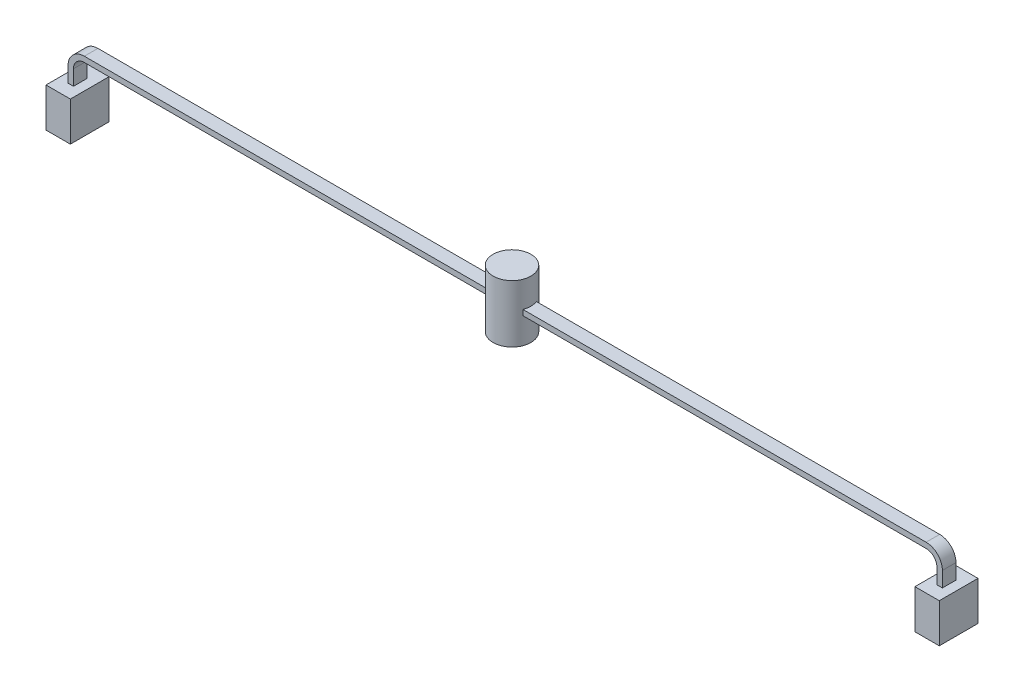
ISO-10303-21;
HEADER;
FILE_DESCRIPTION(('STEP AP214'),'2;1');
FILE_NAME('part.step','',(''),(''),'','','');
FILE_SCHEMA(('AUTOMOTIVE_DESIGN { 1 0 10303 214 1 1 1 1 }'));
ENDSEC;
DATA;
#1=APPLICATION_CONTEXT('core data for automotive mechanical design processes');
#2=APPLICATION_PROTOCOL_DEFINITION('international standard','automotive_design',2000,#1);
#3=PRODUCT_CONTEXT('',#1,'mechanical');
#4=PRODUCT('Part','Part','',(#3));
#5=PRODUCT_RELATED_PRODUCT_CATEGORY('part','',(#4));
#6=PRODUCT_DEFINITION_FORMATION('','',#4);
#7=PRODUCT_DEFINITION_CONTEXT('part definition',#1,'design');
#8=PRODUCT_DEFINITION('design','',#6,#7);
#9=PRODUCT_DEFINITION_SHAPE('','',#8);
#10=(LENGTH_UNIT() NAMED_UNIT(*) SI_UNIT(.MILLI.,.METRE.));
#11=(NAMED_UNIT(*) PLANE_ANGLE_UNIT() SI_UNIT($,.RADIAN.));
#12=(NAMED_UNIT(*) SI_UNIT($,.STERADIAN.) SOLID_ANGLE_UNIT());
#13=UNCERTAINTY_MEASURE_WITH_UNIT(LENGTH_MEASURE(1.E-05),#10,'distance_accuracy_value','');
#14=(GEOMETRIC_REPRESENTATION_CONTEXT(3) GLOBAL_UNCERTAINTY_ASSIGNED_CONTEXT((#13)) GLOBAL_UNIT_ASSIGNED_CONTEXT((#10,
#11,#12)) REPRESENTATION_CONTEXT('',''));
#15=CARTESIAN_POINT('',(0.,0.,0.));
#16=DIRECTION('',(0.,0.,1.));
#17=DIRECTION('',(1.,0.,0.));
#18=AXIS2_PLACEMENT_3D('',#15,#16,#17);
#19=CARTESIAN_POINT('',(0.,13.462,0.));
#20=DIRECTION('',(0.,-1.,0.));
#21=DIRECTION('',(0.,0.,-1.));
#22=AXIS2_PLACEMENT_3D('',#19,#20,#21);
#23=CYLINDRICAL_SURFACE('',#22,8.85255700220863);
#24=CARTESIAN_POINT('',(0.,-13.462,0.));
#25=DIRECTION('',(0.,1.,0.));
#26=DIRECTION('',(0.,0.,1.));
#27=AXIS2_PLACEMENT_3D('',#24,#25,#26);
#28=CIRCLE('',#27,8.85255700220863);
#29=CARTESIAN_POINT('',(0.,-13.462,8.85255700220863));
#30=VERTEX_POINT('',#29);
#31=EDGE_CURVE('E366',#30,#30,#28,.T.);
#32=ORIENTED_EDGE('',*,*,#31,.T.);
#33=EDGE_LOOP('',(#32));
#34=FACE_BOUND('',#33,.T.);
#35=CARTESIAN_POINT('',(0.,13.462,0.));
#36=DIRECTION('',(0.,1.,0.));
#37=DIRECTION('',(0.,0.,1.));
#38=AXIS2_PLACEMENT_3D('',#35,#36,#37);
#39=CIRCLE('',#38,8.85255700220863);
#40=CARTESIAN_POINT('',(0.,13.462,8.85255700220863));
#41=VERTEX_POINT('',#40);
#42=EDGE_CURVE('E367',#41,#41,#39,.T.);
#43=ORIENTED_EDGE('',*,*,#42,.F.);
#44=EDGE_LOOP('',(#43));
#45=FACE_BOUND('',#44,.T.);
#46=CARTESIAN_POINT('',(0.,-1.27,0.));
#47=DIRECTION('',(0.,1.,0.));
#48=DIRECTION('',(0.,0.,1.));
#49=AXIS2_PLACEMENT_3D('',#46,#47,#48);
#50=CIRCLE('',#49,8.85255700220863);
#51=CARTESIAN_POINT('',(8.26360335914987,-1.27,3.175));
#52=VERTEX_POINT('',#51);
#53=CARTESIAN_POINT('',(8.26360335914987,-1.27,-3.175));
#54=VERTEX_POINT('',#53);
#55=EDGE_CURVE('E375',#52,#54,#50,.T.);
#56=ORIENTED_EDGE('',*,*,#55,.F.);
#57=DIRECTION('',(0.,-1.,0.));
#58=VECTOR('',#57,1.);
#59=CARTESIAN_POINT('',(8.26360335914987,13.462,3.175));
#60=LINE('',#59,#58);
#61=CARTESIAN_POINT('',(8.26360335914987,1.27,3.175));
#62=VERTEX_POINT('',#61);
#63=EDGE_CURVE('E57',#52,#62,#60,.F.);
#64=ORIENTED_EDGE('',*,*,#63,.T.);
#65=CARTESIAN_POINT('',(0.,1.27,0.));
#66=DIRECTION('',(0.,1.,0.));
#67=DIRECTION('',(0.,0.,1.));
#68=AXIS2_PLACEMENT_3D('',#65,#66,#67);
#69=CIRCLE('',#68,8.85255700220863);
#70=CARTESIAN_POINT('',(8.26360335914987,1.27,-3.175));
#71=VERTEX_POINT('',#70);
#72=EDGE_CURVE('E378',#62,#71,#69,.T.);
#73=ORIENTED_EDGE('',*,*,#72,.T.);
#74=DIRECTION('',(0.,-1.,0.));
#75=VECTOR('',#74,1.);
#76=CARTESIAN_POINT('',(8.26360335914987,13.462,-3.175));
#77=LINE('',#76,#75);
#78=EDGE_CURVE('E370',#54,#71,#77,.F.);
#79=ORIENTED_EDGE('',*,*,#78,.F.);
#80=EDGE_LOOP('',(#56,#64,#73,#79));
#81=FACE_BOUND('',#80,.T.);
#82=DIRECTION('',(0.,-1.,0.));
#83=VECTOR('',#82,1.);
#84=CARTESIAN_POINT('',(-8.26360335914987,13.462,3.175));
#85=LINE('',#84,#83);
#86=CARTESIAN_POINT('',(-8.26360335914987,-1.27,3.175));
#87=VERTEX_POINT('',#86);
#88=CARTESIAN_POINT('',(-8.26360335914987,1.27,3.175));
#89=VERTEX_POINT('',#88);
#90=EDGE_CURVE('E11',#87,#89,#85,.F.);
#91=ORIENTED_EDGE('',*,*,#90,.F.);
#92=CARTESIAN_POINT('',(0.,-1.27,0.));
#93=DIRECTION('',(0.,-1.,0.));
#94=DIRECTION('',(0.,0.,-1.));
#95=AXIS2_PLACEMENT_3D('',#92,#93,#94);
#96=CIRCLE('',#95,8.85255700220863);
#97=CARTESIAN_POINT('',(-8.26360335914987,-1.27,-3.175));
#98=VERTEX_POINT('',#97);
#99=EDGE_CURVE('E42',#87,#98,#96,.T.);
#100=ORIENTED_EDGE('',*,*,#99,.T.);
#101=DIRECTION('',(0.,-1.,0.));
#102=VECTOR('',#101,1.);
#103=CARTESIAN_POINT('',(-8.26360335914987,13.462,-3.175));
#104=LINE('',#103,#102);
#105=CARTESIAN_POINT('',(-8.26360335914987,1.27,-3.175));
#106=VERTEX_POINT('',#105);
#107=EDGE_CURVE('E381',#98,#106,#104,.F.);
#108=ORIENTED_EDGE('',*,*,#107,.T.);
#109=CARTESIAN_POINT('',(0.,1.27,0.));
#110=DIRECTION('',(0.,-1.,0.));
#111=DIRECTION('',(0.,0.,-1.));
#112=AXIS2_PLACEMENT_3D('',#109,#110,#111);
#113=CIRCLE('',#112,8.85255700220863);
#114=EDGE_CURVE('E384',#89,#106,#113,.T.);
#115=ORIENTED_EDGE('',*,*,#114,.F.);
#116=EDGE_LOOP('',(#91,#100,#108,#115));
#117=FACE_BOUND('',#116,.T.);
#118=ADVANCED_FACE('F35',(#34,#45,#81,#117),#23,.T.);
#119=CARTESIAN_POINT('',(0.,13.462,0.));
#120=DIRECTION('',(0.,1.,0.));
#121=DIRECTION('',(0.,0.,1.));
#122=AXIS2_PLACEMENT_3D('',#119,#120,#121);
#123=PLANE('',#122);
#124=ORIENTED_EDGE('',*,*,#42,.T.);
#125=EDGE_LOOP('',(#124));
#126=FACE_BOUND('',#125,.T.);
#127=ADVANCED_FACE('F433',(#126),#123,.T.);
#128=CARTESIAN_POINT('',(0.,-13.462,0.));
#129=DIRECTION('',(0.,1.,0.));
#130=DIRECTION('',(0.,0.,1.));
#131=AXIS2_PLACEMENT_3D('',#128,#129,#130);
#132=PLANE('',#131);
#133=ORIENTED_EDGE('',*,*,#31,.F.);
#134=EDGE_LOOP('',(#133));
#135=FACE_BOUND('',#134,.T.);
#136=ADVANCED_FACE('F438',(#135),#132,.F.);
#137=CARTESIAN_POINT('',(0.,1.27,3.175));
#138=DIRECTION('',(0.,1.,0.));
#139=DIRECTION('',(0.,0.,1.));
#140=AXIS2_PLACEMENT_3D('',#137,#138,#139);
#141=PLANE('',#140);
#142=ORIENTED_EDGE('',*,*,#72,.F.);
#143=DIRECTION('',(1.,0.,0.));
#144=VECTOR('',#143,1.);
#145=CARTESIAN_POINT('',(0.,1.27,3.175));
#146=LINE('',#145,#144);
#147=CARTESIAN_POINT('',(196.85,1.27,3.175));
#148=VERTEX_POINT('',#147);
#149=EDGE_CURVE('E328',#62,#148,#146,.T.);
#150=ORIENTED_EDGE('',*,*,#149,.T.);
#151=DIRECTION('',(0.,0.,-1.));
#152=VECTOR('',#151,1.);
#153=CARTESIAN_POINT('',(196.85,1.27,3.175));
#154=LINE('',#153,#152);
#155=CARTESIAN_POINT('',(196.85,1.27,-3.175));
#156=VERTEX_POINT('',#155);
#157=EDGE_CURVE('E356',#148,#156,#154,.T.);
#158=ORIENTED_EDGE('',*,*,#157,.T.);
#159=DIRECTION('',(1.,0.,0.));
#160=VECTOR('',#159,1.);
#161=CARTESIAN_POINT('',(0.,1.27,-3.175));
#162=LINE('',#161,#160);
#163=EDGE_CURVE('E346',#71,#156,#162,.T.);
#164=ORIENTED_EDGE('',*,*,#163,.F.);
#165=EDGE_LOOP('',(#142,#150,#158,#164));
#166=FACE_BOUND('',#165,.T.);
#167=ADVANCED_FACE('F478',(#166),#141,.T.);
#168=CARTESIAN_POINT('',(0.,-1.27,3.175));
#169=DIRECTION('',(0.,1.,0.));
#170=DIRECTION('',(0.,0.,1.));
#171=AXIS2_PLACEMENT_3D('',#168,#169,#170);
#172=PLANE('',#171);
#173=DIRECTION('',(1.,0.,0.));
#174=VECTOR('',#173,1.);
#175=CARTESIAN_POINT('',(0.,-1.27,3.175));
#176=LINE('',#175,#174);
#177=CARTESIAN_POINT('',(196.85,-1.27,3.175));
#178=VERTEX_POINT('',#177);
#179=EDGE_CURVE('E330',#52,#178,#176,.T.);
#180=ORIENTED_EDGE('',*,*,#179,.F.);
#181=ORIENTED_EDGE('',*,*,#55,.T.);
#182=DIRECTION('',(1.,0.,0.));
#183=VECTOR('',#182,1.);
#184=CARTESIAN_POINT('',(0.,-1.27,-3.175));
#185=LINE('',#184,#183);
#186=CARTESIAN_POINT('',(196.85,-1.27,-3.175));
#187=VERTEX_POINT('',#186);
#188=EDGE_CURVE('E348',#54,#187,#185,.T.);
#189=ORIENTED_EDGE('',*,*,#188,.T.);
#190=DIRECTION('',(0.,0.,-1.));
#191=VECTOR('',#190,1.);
#192=CARTESIAN_POINT('',(196.85,-1.27,3.175));
#193=LINE('',#192,#191);
#194=EDGE_CURVE('E353',#178,#187,#193,.T.);
#195=ORIENTED_EDGE('',*,*,#194,.F.);
#196=EDGE_LOOP('',(#180,#181,#189,#195));
#197=FACE_BOUND('',#196,.T.);
#198=ADVANCED_FACE('F452',(#197),#172,.F.);
#199=CARTESIAN_POINT('',(196.85,-6.35,3.175));
#200=DIRECTION('',(0.,0.,1.));
#201=DIRECTION('',(1.,0.,0.));
#202=AXIS2_PLACEMENT_3D('',#199,#200,#201);
#203=PLANE('',#202);
#204=ORIENTED_EDGE('',*,*,#63,.F.);
#205=ORIENTED_EDGE('',*,*,#179,.T.);
#206=CARTESIAN_POINT('',(196.85,-6.35,3.175));
#207=DIRECTION('',(0.,0.,1.));
#208=DIRECTION('',(1.,0.,0.));
#209=AXIS2_PLACEMENT_3D('',#206,#207,#208);
#210=CIRCLE('',#209,5.08);
#211=CARTESIAN_POINT('',(201.93,-6.35,3.175));
#212=VERTEX_POINT('',#211);
#213=EDGE_CURVE('E332',#178,#212,#210,.F.);
#214=ORIENTED_EDGE('',*,*,#213,.T.);
#215=DIRECTION('',(0.,1.,0.));
#216=VECTOR('',#215,1.);
#217=CARTESIAN_POINT('',(201.93,-6.35,3.175));
#218=LINE('',#217,#216);
#219=CARTESIAN_POINT('',(201.93,-13.462,3.175));
#220=VERTEX_POINT('',#219);
#221=EDGE_CURVE('E316',#212,#220,#218,.F.);
#222=ORIENTED_EDGE('',*,*,#221,.T.);
#223=DIRECTION('',(-1.,0.,0.));
#224=VECTOR('',#223,1.);
#225=CARTESIAN_POINT('',(204.47,-13.462,3.175));
#226=LINE('',#225,#224);
#227=CARTESIAN_POINT('',(204.47,-13.462,3.175));
#228=VERTEX_POINT('',#227);
#229=EDGE_CURVE('E319',#228,#220,#226,.T.);
#230=ORIENTED_EDGE('',*,*,#229,.F.);
#231=DIRECTION('',(0.,1.,0.));
#232=VECTOR('',#231,1.);
#233=CARTESIAN_POINT('',(204.47,-6.35,3.175));
#234=LINE('',#233,#232);
#235=CARTESIAN_POINT('',(204.47,-6.35,3.175));
#236=VERTEX_POINT('',#235);
#237=EDGE_CURVE('E322',#236,#228,#234,.F.);
#238=ORIENTED_EDGE('',*,*,#237,.F.);
#239=CARTESIAN_POINT('',(196.85,-6.35,3.175));
#240=DIRECTION('',(0.,0.,1.));
#241=DIRECTION('',(1.,0.,0.));
#242=AXIS2_PLACEMENT_3D('',#239,#240,#241);
#243=CIRCLE('',#242,7.62);
#244=EDGE_CURVE('E325',#148,#236,#243,.F.);
#245=ORIENTED_EDGE('',*,*,#244,.F.);
#246=ORIENTED_EDGE('',*,*,#149,.F.);
#247=EDGE_LOOP('',(#204,#205,#214,#222,#230,#238,#245,#246));
#248=FACE_BOUND('',#247,.T.);
#249=ADVANCED_FACE('F449',(#248),#203,.T.);
#250=CARTESIAN_POINT('',(196.85,-6.35,-3.175));
#251=DIRECTION('',(0.,0.,1.));
#252=DIRECTION('',(1.,0.,0.));
#253=AXIS2_PLACEMENT_3D('',#250,#251,#252);
#254=PLANE('',#253);
#255=ORIENTED_EDGE('',*,*,#188,.F.);
#256=ORIENTED_EDGE('',*,*,#78,.T.);
#257=ORIENTED_EDGE('',*,*,#163,.T.);
#258=CARTESIAN_POINT('',(196.85,-6.35,-3.175));
#259=DIRECTION('',(0.,0.,1.));
#260=DIRECTION('',(1.,0.,0.));
#261=AXIS2_PLACEMENT_3D('',#258,#259,#260);
#262=CIRCLE('',#261,7.62);
#263=CARTESIAN_POINT('',(204.47,-6.35,-3.175));
#264=VERTEX_POINT('',#263);
#265=EDGE_CURVE('E343',#156,#264,#262,.F.);
#266=ORIENTED_EDGE('',*,*,#265,.T.);
#267=DIRECTION('',(0.,1.,0.));
#268=VECTOR('',#267,1.);
#269=CARTESIAN_POINT('',(204.47,-6.35,-3.175));
#270=LINE('',#269,#268);
#271=CARTESIAN_POINT('',(204.47,-13.462,-3.175));
#272=VERTEX_POINT('',#271);
#273=EDGE_CURVE('E340',#264,#272,#270,.F.);
#274=ORIENTED_EDGE('',*,*,#273,.T.);
#275=DIRECTION('',(-1.,0.,0.));
#276=VECTOR('',#275,1.);
#277=CARTESIAN_POINT('',(204.47,-13.462,-3.175));
#278=LINE('',#277,#276);
#279=CARTESIAN_POINT('',(201.93,-13.462,-3.175));
#280=VERTEX_POINT('',#279);
#281=EDGE_CURVE('E337',#272,#280,#278,.T.);
#282=ORIENTED_EDGE('',*,*,#281,.T.);
#283=DIRECTION('',(0.,1.,0.));
#284=VECTOR('',#283,1.);
#285=CARTESIAN_POINT('',(201.93,-6.35,-3.175));
#286=LINE('',#285,#284);
#287=CARTESIAN_POINT('',(201.93,-6.35,-3.175));
#288=VERTEX_POINT('',#287);
#289=EDGE_CURVE('E315',#288,#280,#286,.F.);
#290=ORIENTED_EDGE('',*,*,#289,.F.);
#291=CARTESIAN_POINT('',(196.85,-6.35,-3.175));
#292=DIRECTION('',(0.,0.,1.));
#293=DIRECTION('',(1.,0.,0.));
#294=AXIS2_PLACEMENT_3D('',#291,#292,#293);
#295=CIRCLE('',#294,5.08);
#296=EDGE_CURVE('E320',#187,#288,#295,.F.);
#297=ORIENTED_EDGE('',*,*,#296,.F.);
#298=EDGE_LOOP('',(#255,#256,#257,#266,#274,#282,#290,#297));
#299=FACE_BOUND('',#298,.T.);
#300=ADVANCED_FACE('F471',(#299),#254,.F.);
#301=CARTESIAN_POINT('',(201.93,-6.35,3.175));
#302=DIRECTION('',(1.,0.,0.));
#303=DIRECTION('',(0.,0.,-1.));
#304=AXIS2_PLACEMENT_3D('',#301,#302,#303);
#305=PLANE('',#304);
#306=ORIENTED_EDGE('',*,*,#289,.T.);
#307=DIRECTION('',(0.,0.,-1.));
#308=VECTOR('',#307,1.);
#309=CARTESIAN_POINT('',(201.93,-13.462,3.175));
#310=LINE('',#309,#308);
#311=EDGE_CURVE('E364',#220,#280,#310,.T.);
#312=ORIENTED_EDGE('',*,*,#311,.F.);
#313=ORIENTED_EDGE('',*,*,#221,.F.);
#314=DIRECTION('',(0.,0.,-1.));
#315=VECTOR('',#314,1.);
#316=CARTESIAN_POINT('',(201.93,-6.35,3.175));
#317=LINE('',#316,#315);
#318=EDGE_CURVE('E334',#212,#288,#317,.T.);
#319=ORIENTED_EDGE('',*,*,#318,.T.);
#320=EDGE_LOOP('',(#306,#312,#313,#319));
#321=FACE_BOUND('',#320,.T.);
#322=ADVANCED_FACE('F463',(#321),#305,.F.);
#323=CARTESIAN_POINT('',(204.47,-6.35,3.175));
#324=DIRECTION('',(1.,0.,0.));
#325=DIRECTION('',(0.,0.,-1.));
#326=AXIS2_PLACEMENT_3D('',#323,#324,#325);
#327=PLANE('',#326);
#328=ORIENTED_EDGE('',*,*,#273,.F.);
#329=DIRECTION('',(0.,0.,-1.));
#330=VECTOR('',#329,1.);
#331=CARTESIAN_POINT('',(204.47,-6.35,3.175));
#332=LINE('',#331,#330);
#333=EDGE_CURVE('E359',#236,#264,#332,.T.);
#334=ORIENTED_EDGE('',*,*,#333,.F.);
#335=ORIENTED_EDGE('',*,*,#237,.T.);
#336=DIRECTION('',(0.,0.,-1.));
#337=VECTOR('',#336,1.);
#338=CARTESIAN_POINT('',(204.47,-13.462,3.175));
#339=LINE('',#338,#337);
#340=EDGE_CURVE('E361',#228,#272,#339,.T.);
#341=ORIENTED_EDGE('',*,*,#340,.T.);
#342=EDGE_LOOP('',(#328,#334,#335,#341));
#343=FACE_BOUND('',#342,.T.);
#344=ADVANCED_FACE('F469',(#343),#327,.T.);
#345=CARTESIAN_POINT('',(196.85,-6.35,3.175));
#346=DIRECTION('',(0.,0.,-1.));
#347=DIRECTION('',(-1.,0.,0.));
#348=AXIS2_PLACEMENT_3D('',#345,#346,#347);
#349=CYLINDRICAL_SURFACE('',#348,7.62);
#350=ORIENTED_EDGE('',*,*,#265,.F.);
#351=ORIENTED_EDGE('',*,*,#157,.F.);
#352=ORIENTED_EDGE('',*,*,#244,.T.);
#353=ORIENTED_EDGE('',*,*,#333,.T.);
#354=EDGE_LOOP('',(#350,#351,#352,#353));
#355=FACE_BOUND('',#354,.T.);
#356=ADVANCED_FACE('F476',(#355),#349,.T.);
#357=CARTESIAN_POINT('',(196.85,-6.35,3.175));
#358=DIRECTION('',(0.,0.,-1.));
#359=DIRECTION('',(-1.,0.,0.));
#360=AXIS2_PLACEMENT_3D('',#357,#358,#359);
#361=CYLINDRICAL_SURFACE('',#360,5.08);
#362=ORIENTED_EDGE('',*,*,#296,.T.);
#363=ORIENTED_EDGE('',*,*,#318,.F.);
#364=ORIENTED_EDGE('',*,*,#213,.F.);
#365=ORIENTED_EDGE('',*,*,#194,.T.);
#366=EDGE_LOOP('',(#362,#363,#364,#365));
#367=FACE_BOUND('',#366,.T.);
#368=ADVANCED_FACE('F457',(#367),#361,.F.);
#369=CARTESIAN_POINT('',(197.505478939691,-13.462,-9.05704742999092));
#370=DIRECTION('',(0.,-1.,0.));
#371=DIRECTION('',(0.,0.,-1.));
#372=AXIS2_PLACEMENT_3D('',#369,#370,#371);
#373=PLANE('',#372);
#374=DIRECTION('',(0.,0.,-1.));
#375=VECTOR('',#374,1.);
#376=CARTESIAN_POINT('',(197.505478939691,-13.462,9.05704742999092));
#377=LINE('',#376,#375);
#378=CARTESIAN_POINT('',(197.505478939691,-13.462,9.05704742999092));
#379=VERTEX_POINT('',#378);
#380=CARTESIAN_POINT('',(197.505478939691,-13.462,-9.05704742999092));
#381=VERTEX_POINT('',#380);
#382=EDGE_CURVE('E285',#379,#381,#377,.T.);
#383=ORIENTED_EDGE('',*,*,#382,.F.);
#384=DIRECTION('',(-1.,0.,0.));
#385=VECTOR('',#384,1.);
#386=CARTESIAN_POINT('',(197.505478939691,-13.462,9.05704742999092));
#387=LINE('',#386,#385);
#388=CARTESIAN_POINT('',(208.894521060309,-13.462,9.05704742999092));
#389=VERTEX_POINT('',#388);
#390=EDGE_CURVE('E290',#389,#379,#387,.T.);
#391=ORIENTED_EDGE('',*,*,#390,.F.);
#392=DIRECTION('',(0.,0.,1.));
#393=VECTOR('',#392,1.);
#394=CARTESIAN_POINT('',(208.894521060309,-13.462,9.05704742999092));
#395=LINE('',#394,#393);
#396=CARTESIAN_POINT('',(208.894521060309,-13.462,-9.05704742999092));
#397=VERTEX_POINT('',#396);
#398=EDGE_CURVE('E301',#397,#389,#395,.T.);
#399=ORIENTED_EDGE('',*,*,#398,.F.);
#400=DIRECTION('',(1.,0.,0.));
#401=VECTOR('',#400,1.);
#402=CARTESIAN_POINT('',(197.505478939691,-13.462,-9.05704742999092));
#403=LINE('',#402,#401);
#404=EDGE_CURVE('E299',#381,#397,#403,.T.);
#405=ORIENTED_EDGE('',*,*,#404,.F.);
#406=EDGE_LOOP('',(#383,#391,#399,#405));
#407=FACE_BOUND('',#406,.T.);
#408=ORIENTED_EDGE('',*,*,#229,.T.);
#409=ORIENTED_EDGE('',*,*,#311,.T.);
#410=ORIENTED_EDGE('',*,*,#281,.F.);
#411=ORIENTED_EDGE('',*,*,#340,.F.);
#412=EDGE_LOOP('',(#408,#409,#410,#411));
#413=FACE_BOUND('',#412,.T.);
#414=ADVANCED_FACE('F466',(#407,#413),#373,.F.);
#415=CARTESIAN_POINT('',(197.505478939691,-31.75,9.05704742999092));
#416=DIRECTION('',(1.,0.,0.));
#417=DIRECTION('',(0.,0.,-1.));
#418=AXIS2_PLACEMENT_3D('',#415,#416,#417);
#419=PLANE('',#418);
#420=ORIENTED_EDGE('',*,*,#382,.T.);
#421=DIRECTION('',(0.,1.,0.));
#422=VECTOR('',#421,1.);
#423=CARTESIAN_POINT('',(197.505478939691,-31.75,-9.05704742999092));
#424=LINE('',#423,#422);
#425=CARTESIAN_POINT('',(197.505478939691,-31.75,-9.05704742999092));
#426=VERTEX_POINT('',#425);
#427=EDGE_CURVE('E312',#426,#381,#424,.T.);
#428=ORIENTED_EDGE('',*,*,#427,.F.);
#429=DIRECTION('',(0.,0.,-1.));
#430=VECTOR('',#429,1.);
#431=CARTESIAN_POINT('',(197.505478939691,-31.75,9.05704742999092));
#432=LINE('',#431,#430);
#433=CARTESIAN_POINT('',(197.505478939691,-31.75,9.05704742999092));
#434=VERTEX_POINT('',#433);
#435=EDGE_CURVE('E286',#434,#426,#432,.T.);
#436=ORIENTED_EDGE('',*,*,#435,.F.);
#437=DIRECTION('',(0.,1.,0.));
#438=VECTOR('',#437,1.);
#439=CARTESIAN_POINT('',(197.505478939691,-31.75,9.05704742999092));
#440=LINE('',#439,#438);
#441=EDGE_CURVE('E296',#434,#379,#440,.T.);
#442=ORIENTED_EDGE('',*,*,#441,.T.);
#443=EDGE_LOOP('',(#420,#428,#436,#442));
#444=FACE_BOUND('',#443,.T.);
#445=ADVANCED_FACE('F507',(#444),#419,.F.);
#446=CARTESIAN_POINT('',(197.505478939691,-31.75,-9.05704742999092));
#447=DIRECTION('',(0.,0.,1.));
#448=DIRECTION('',(1.,0.,0.));
#449=AXIS2_PLACEMENT_3D('',#446,#447,#448);
#450=PLANE('',#449);
#451=ORIENTED_EDGE('',*,*,#404,.T.);
#452=DIRECTION('',(0.,1.,0.));
#453=VECTOR('',#452,1.);
#454=CARTESIAN_POINT('',(208.894521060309,-31.75,-9.05704742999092));
#455=LINE('',#454,#453);
#456=CARTESIAN_POINT('',(208.894521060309,-31.75,-9.05704742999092));
#457=VERTEX_POINT('',#456);
#458=EDGE_CURVE('E309',#457,#397,#455,.T.);
#459=ORIENTED_EDGE('',*,*,#458,.F.);
#460=DIRECTION('',(1.,0.,0.));
#461=VECTOR('',#460,1.);
#462=CARTESIAN_POINT('',(197.505478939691,-31.75,-9.05704742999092));
#463=LINE('',#462,#461);
#464=EDGE_CURVE('E289',#426,#457,#463,.T.);
#465=ORIENTED_EDGE('',*,*,#464,.F.);
#466=ORIENTED_EDGE('',*,*,#427,.T.);
#467=EDGE_LOOP('',(#451,#459,#465,#466));
#468=FACE_BOUND('',#467,.T.);
#469=ADVANCED_FACE('F513',(#468),#450,.F.);
#470=CARTESIAN_POINT('',(208.894521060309,-31.75,9.05704742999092));
#471=DIRECTION('',(-1.,0.,0.));
#472=DIRECTION('',(0.,0.,1.));
#473=AXIS2_PLACEMENT_3D('',#470,#471,#472);
#474=PLANE('',#473);
#475=ORIENTED_EDGE('',*,*,#398,.T.);
#476=DIRECTION('',(0.,1.,0.));
#477=VECTOR('',#476,1.);
#478=CARTESIAN_POINT('',(208.894521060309,-31.75,9.05704742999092));
#479=LINE('',#478,#477);
#480=CARTESIAN_POINT('',(208.894521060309,-31.75,9.05704742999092));
#481=VERTEX_POINT('',#480);
#482=EDGE_CURVE('E306',#481,#389,#479,.T.);
#483=ORIENTED_EDGE('',*,*,#482,.F.);
#484=DIRECTION('',(0.,0.,1.));
#485=VECTOR('',#484,1.);
#486=CARTESIAN_POINT('',(208.894521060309,-31.75,9.05704742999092));
#487=LINE('',#486,#485);
#488=EDGE_CURVE('E292',#457,#481,#487,.T.);
#489=ORIENTED_EDGE('',*,*,#488,.F.);
#490=ORIENTED_EDGE('',*,*,#458,.T.);
#491=EDGE_LOOP('',(#475,#483,#489,#490));
#492=FACE_BOUND('',#491,.T.);
#493=ADVANCED_FACE('F521',(#492),#474,.F.);
#494=CARTESIAN_POINT('',(197.505478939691,-31.75,9.05704742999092));
#495=DIRECTION('',(0.,0.,-1.));
#496=DIRECTION('',(-1.,0.,0.));
#497=AXIS2_PLACEMENT_3D('',#494,#495,#496);
#498=PLANE('',#497);
#499=ORIENTED_EDGE('',*,*,#390,.T.);
#500=ORIENTED_EDGE('',*,*,#441,.F.);
#501=DIRECTION('',(-1.,0.,0.));
#502=VECTOR('',#501,1.);
#503=CARTESIAN_POINT('',(197.505478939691,-31.75,9.05704742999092));
#504=LINE('',#503,#502);
#505=EDGE_CURVE('E294',#481,#434,#504,.T.);
#506=ORIENTED_EDGE('',*,*,#505,.F.);
#507=ORIENTED_EDGE('',*,*,#482,.T.);
#508=EDGE_LOOP('',(#499,#500,#506,#507));
#509=FACE_BOUND('',#508,.T.);
#510=ADVANCED_FACE('F518',(#509),#498,.F.);
#511=CARTESIAN_POINT('',(197.505478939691,-31.75,-9.05704742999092));
#512=DIRECTION('',(0.,-1.,0.));
#513=DIRECTION('',(0.,0.,-1.));
#514=AXIS2_PLACEMENT_3D('',#511,#512,#513);
#515=PLANE('',#514);
#516=ORIENTED_EDGE('',*,*,#435,.T.);
#517=ORIENTED_EDGE('',*,*,#464,.T.);
#518=ORIENTED_EDGE('',*,*,#488,.T.);
#519=ORIENTED_EDGE('',*,*,#505,.T.);
#520=EDGE_LOOP('',(#516,#517,#518,#519));
#521=FACE_BOUND('',#520,.T.);
#522=ADVANCED_FACE('F517',(#521),#515,.T.);
#523=CARTESIAN_POINT('',(0.,-1.27,3.175));
#524=DIRECTION('',(0.,-1.,0.));
#525=DIRECTION('',(0.,0.,-1.));
#526=AXIS2_PLACEMENT_3D('',#523,#524,#525);
#527=PLANE('',#526);
#528=ORIENTED_EDGE('',*,*,#99,.F.);
#529=DIRECTION('',(-1.,0.,0.));
#530=VECTOR('',#529,1.);
#531=CARTESIAN_POINT('',(0.,-1.27,3.175));
#532=LINE('',#531,#530);
#533=CARTESIAN_POINT('',(-196.85,-1.27,3.175));
#534=VERTEX_POINT('',#533);
#535=EDGE_CURVE('E244',#87,#534,#532,.T.);
#536=ORIENTED_EDGE('',*,*,#535,.T.);
#537=DIRECTION('',(0.,0.,-1.));
#538=VECTOR('',#537,1.);
#539=CARTESIAN_POINT('',(-196.85,-1.27,3.175));
#540=LINE('',#539,#538);
#541=CARTESIAN_POINT('',(-196.85,-1.27,-3.175));
#542=VERTEX_POINT('',#541);
#543=EDGE_CURVE('E280',#534,#542,#540,.T.);
#544=ORIENTED_EDGE('',*,*,#543,.T.);
#545=DIRECTION('',(-1.,0.,0.));
#546=VECTOR('',#545,1.);
#547=CARTESIAN_POINT('',(0.,-1.27,-3.175));
#548=LINE('',#547,#546);
#549=EDGE_CURVE('E260',#98,#542,#548,.T.);
#550=ORIENTED_EDGE('',*,*,#549,.F.);
#551=EDGE_LOOP('',(#528,#536,#544,#550));
#552=FACE_BOUND('',#551,.T.);
#553=ADVANCED_FACE('F392',(#552),#527,.T.);
#554=CARTESIAN_POINT('',(0.,1.27,3.175));
#555=DIRECTION('',(0.,-1.,0.));
#556=DIRECTION('',(0.,0.,-1.));
#557=AXIS2_PLACEMENT_3D('',#554,#555,#556);
#558=PLANE('',#557);
#559=DIRECTION('',(-1.,0.,0.));
#560=VECTOR('',#559,1.);
#561=CARTESIAN_POINT('',(0.,1.27,3.175));
#562=LINE('',#561,#560);
#563=CARTESIAN_POINT('',(-196.85,1.27,3.175));
#564=VERTEX_POINT('',#563);
#565=EDGE_CURVE('E246',#89,#564,#562,.T.);
#566=ORIENTED_EDGE('',*,*,#565,.F.);
#567=ORIENTED_EDGE('',*,*,#114,.T.);
#568=DIRECTION('',(-1.,0.,0.));
#569=VECTOR('',#568,1.);
#570=CARTESIAN_POINT('',(0.,1.27,-3.175));
#571=LINE('',#570,#569);
#572=CARTESIAN_POINT('',(-196.85,1.27,-3.175));
#573=VERTEX_POINT('',#572);
#574=EDGE_CURVE('E49',#106,#573,#571,.T.);
#575=ORIENTED_EDGE('',*,*,#574,.T.);
#576=DIRECTION('',(0.,0.,-1.));
#577=VECTOR('',#576,1.);
#578=CARTESIAN_POINT('',(-196.85,1.27,3.175));
#579=LINE('',#578,#577);
#580=EDGE_CURVE('E277',#564,#573,#579,.T.);
#581=ORIENTED_EDGE('',*,*,#580,.F.);
#582=EDGE_LOOP('',(#566,#567,#575,#581));
#583=FACE_BOUND('',#582,.T.);
#584=ADVANCED_FACE('F421',(#583),#558,.F.);
#585=CARTESIAN_POINT('',(-196.85,-6.35,3.175));
#586=DIRECTION('',(0.,0.,-1.));
#587=DIRECTION('',(-1.,0.,0.));
#588=AXIS2_PLACEMENT_3D('',#585,#586,#587);
#589=PLANE('',#588);
#590=ORIENTED_EDGE('',*,*,#535,.F.);
#591=ORIENTED_EDGE('',*,*,#90,.T.);
#592=ORIENTED_EDGE('',*,*,#565,.T.);
#593=CARTESIAN_POINT('',(-196.85,-6.35,3.175));
#594=DIRECTION('',(0.,0.,-1.));
#595=DIRECTION('',(-1.,0.,0.));
#596=AXIS2_PLACEMENT_3D('',#593,#594,#595);
#597=CIRCLE('',#596,7.62);
#598=CARTESIAN_POINT('',(-204.47,-6.35,3.175));
#599=VERTEX_POINT('',#598);
#600=EDGE_CURVE('E248',#564,#599,#597,.F.);
#601=ORIENTED_EDGE('',*,*,#600,.T.);
#602=DIRECTION('',(0.,1.,0.));
#603=VECTOR('',#602,1.);
#604=CARTESIAN_POINT('',(-204.47,-6.35,3.175));
#605=LINE('',#604,#603);
#606=CARTESIAN_POINT('',(-204.47,-13.462,3.175));
#607=VERTEX_POINT('',#606);
#608=EDGE_CURVE('E250',#599,#607,#605,.F.);
#609=ORIENTED_EDGE('',*,*,#608,.T.);
#610=DIRECTION('',(1.,0.,0.));
#611=VECTOR('',#610,1.);
#612=CARTESIAN_POINT('',(-204.47,-13.462,3.175));
#613=LINE('',#612,#611);
#614=CARTESIAN_POINT('',(-201.93,-13.462,3.175));
#615=VERTEX_POINT('',#614);
#616=EDGE_CURVE('E252',#607,#615,#613,.T.);
#617=ORIENTED_EDGE('',*,*,#616,.T.);
#618=DIRECTION('',(0.,1.,0.));
#619=VECTOR('',#618,1.);
#620=CARTESIAN_POINT('',(-201.93,-6.35,3.175));
#621=LINE('',#620,#619);
#622=CARTESIAN_POINT('',(-201.93,-6.35,3.175));
#623=VERTEX_POINT('',#622);
#624=EDGE_CURVE('E237',#623,#615,#621,.F.);
#625=ORIENTED_EDGE('',*,*,#624,.F.);
#626=CARTESIAN_POINT('',(-196.85,-6.35,3.175));
#627=DIRECTION('',(0.,0.,-1.));
#628=DIRECTION('',(-1.,0.,0.));
#629=AXIS2_PLACEMENT_3D('',#626,#627,#628);
#630=CIRCLE('',#629,5.08);
#631=EDGE_CURVE('E240',#534,#623,#630,.F.);
#632=ORIENTED_EDGE('',*,*,#631,.F.);
#633=EDGE_LOOP('',(#590,#591,#592,#601,#609,#617,#625,#632));
#634=FACE_BOUND('',#633,.T.);
#635=ADVANCED_FACE('F396',(#634),#589,.F.);
#636=CARTESIAN_POINT('',(-196.85,-6.35,-3.175));
#637=DIRECTION('',(0.,0.,-1.));
#638=DIRECTION('',(-1.,0.,0.));
#639=AXIS2_PLACEMENT_3D('',#636,#637,#638);
#640=PLANE('',#639);
#641=ORIENTED_EDGE('',*,*,#107,.F.);
#642=ORIENTED_EDGE('',*,*,#549,.T.);
#643=CARTESIAN_POINT('',(-196.85,-6.35,-3.175));
#644=DIRECTION('',(0.,0.,-1.));
#645=DIRECTION('',(-1.,0.,0.));
#646=AXIS2_PLACEMENT_3D('',#643,#644,#645);
#647=CIRCLE('',#646,5.08);
#648=CARTESIAN_POINT('',(-201.93,-6.35,-3.175));
#649=VERTEX_POINT('',#648);
#650=EDGE_CURVE('E257',#542,#649,#647,.F.);
#651=ORIENTED_EDGE('',*,*,#650,.T.);
#652=DIRECTION('',(0.,1.,0.));
#653=VECTOR('',#652,1.);
#654=CARTESIAN_POINT('',(-201.93,-6.35,-3.175));
#655=LINE('',#654,#653);
#656=CARTESIAN_POINT('',(-201.93,-13.462,-3.175));
#657=VERTEX_POINT('',#656);
#658=EDGE_CURVE('E205',#649,#657,#655,.F.);
#659=ORIENTED_EDGE('',*,*,#658,.T.);
#660=DIRECTION('',(1.,0.,0.));
#661=VECTOR('',#660,1.);
#662=CARTESIAN_POINT('',(-204.47,-13.462,-3.175));
#663=LINE('',#662,#661);
#664=CARTESIAN_POINT('',(-204.47,-13.462,-3.175));
#665=VERTEX_POINT('',#664);
#666=EDGE_CURVE('E241',#665,#657,#663,.T.);
#667=ORIENTED_EDGE('',*,*,#666,.F.);
#668=DIRECTION('',(0.,1.,0.));
#669=VECTOR('',#668,1.);
#670=CARTESIAN_POINT('',(-204.47,-6.35,-3.175));
#671=LINE('',#670,#669);
#672=CARTESIAN_POINT('',(-204.47,-6.35,-3.175));
#673=VERTEX_POINT('',#672);
#674=EDGE_CURVE('E265',#673,#665,#671,.F.);
#675=ORIENTED_EDGE('',*,*,#674,.F.);
#676=CARTESIAN_POINT('',(-196.85,-6.35,-3.175));
#677=DIRECTION('',(0.,0.,-1.));
#678=DIRECTION('',(-1.,0.,0.));
#679=AXIS2_PLACEMENT_3D('',#676,#677,#678);
#680=CIRCLE('',#679,7.62);
#681=EDGE_CURVE('E263',#573,#673,#680,.F.);
#682=ORIENTED_EDGE('',*,*,#681,.F.);
#683=ORIENTED_EDGE('',*,*,#574,.F.);
#684=EDGE_LOOP('',(#641,#642,#651,#659,#667,#675,#682,#683));
#685=FACE_BOUND('',#684,.T.);
#686=ADVANCED_FACE('F403',(#685),#640,.T.);
#687=CARTESIAN_POINT('',(-201.93,-6.35,3.175));
#688=DIRECTION('',(1.,0.,0.));
#689=DIRECTION('',(0.,0.,-1.));
#690=AXIS2_PLACEMENT_3D('',#687,#688,#689);
#691=PLANE('',#690);
#692=ORIENTED_EDGE('',*,*,#658,.F.);
#693=DIRECTION('',(0.,0.,-1.));
#694=VECTOR('',#693,1.);
#695=CARTESIAN_POINT('',(-201.93,-6.35,3.175));
#696=LINE('',#695,#694);
#697=EDGE_CURVE('E283',#623,#649,#696,.T.);
#698=ORIENTED_EDGE('',*,*,#697,.F.);
#699=ORIENTED_EDGE('',*,*,#624,.T.);
#700=DIRECTION('',(0.,0.,-1.));
#701=VECTOR('',#700,1.);
#702=CARTESIAN_POINT('',(-201.93,-13.462,3.175));
#703=LINE('',#702,#701);
#704=EDGE_CURVE('E254',#615,#657,#703,.T.);
#705=ORIENTED_EDGE('',*,*,#704,.T.);
#706=EDGE_LOOP('',(#692,#698,#699,#705));
#707=FACE_BOUND('',#706,.T.);
#708=ADVANCED_FACE('F422',(#707),#691,.T.);
#709=CARTESIAN_POINT('',(-196.85,-6.35,3.175));
#710=DIRECTION('',(0.,0.,-1.));
#711=DIRECTION('',(-1.,0.,0.));
#712=AXIS2_PLACEMENT_3D('',#709,#710,#711);
#713=CYLINDRICAL_SURFACE('',#712,5.08);
#714=ORIENTED_EDGE('',*,*,#650,.F.);
#715=ORIENTED_EDGE('',*,*,#543,.F.);
#716=ORIENTED_EDGE('',*,*,#631,.T.);
#717=ORIENTED_EDGE('',*,*,#697,.T.);
#718=EDGE_LOOP('',(#714,#715,#716,#717));
#719=FACE_BOUND('',#718,.T.);
#720=ADVANCED_FACE('F401',(#719),#713,.F.);
#721=CARTESIAN_POINT('',(-196.85,-6.35,3.175));
#722=DIRECTION('',(0.,0.,-1.));
#723=DIRECTION('',(-1.,0.,0.));
#724=AXIS2_PLACEMENT_3D('',#721,#722,#723);
#725=CYLINDRICAL_SURFACE('',#724,7.62);
#726=ORIENTED_EDGE('',*,*,#681,.T.);
#727=DIRECTION('',(0.,0.,-1.));
#728=VECTOR('',#727,1.);
#729=CARTESIAN_POINT('',(-204.47,-6.35,3.175));
#730=LINE('',#729,#728);
#731=EDGE_CURVE('E274',#599,#673,#730,.T.);
#732=ORIENTED_EDGE('',*,*,#731,.F.);
#733=ORIENTED_EDGE('',*,*,#600,.F.);
#734=ORIENTED_EDGE('',*,*,#580,.T.);
#735=EDGE_LOOP('',(#726,#732,#733,#734));
#736=FACE_BOUND('',#735,.T.);
#737=ADVANCED_FACE('F417',(#736),#725,.T.);
#738=CARTESIAN_POINT('',(-204.47,-6.35,3.175));
#739=DIRECTION('',(1.,0.,0.));
#740=DIRECTION('',(0.,0.,-1.));
#741=AXIS2_PLACEMENT_3D('',#738,#739,#740);
#742=PLANE('',#741);
#743=ORIENTED_EDGE('',*,*,#674,.T.);
#744=DIRECTION('',(0.,0.,-1.));
#745=VECTOR('',#744,1.);
#746=CARTESIAN_POINT('',(-204.47,-13.462,3.175));
#747=LINE('',#746,#745);
#748=EDGE_CURVE('E271',#607,#665,#747,.T.);
#749=ORIENTED_EDGE('',*,*,#748,.F.);
#750=ORIENTED_EDGE('',*,*,#608,.F.);
#751=ORIENTED_EDGE('',*,*,#731,.T.);
#752=EDGE_LOOP('',(#743,#749,#750,#751));
#753=FACE_BOUND('',#752,.T.);
#754=ADVANCED_FACE('F414',(#753),#742,.F.);
#755=CARTESIAN_POINT('',(-197.505478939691,-31.75,9.05704742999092));
#756=DIRECTION('',(1.,0.,0.));
#757=DIRECTION('',(0.,0.,-1.));
#758=AXIS2_PLACEMENT_3D('',#755,#756,#757);
#759=PLANE('',#758);
#760=DIRECTION('',(0.,0.,-1.));
#761=VECTOR('',#760,1.);
#762=CARTESIAN_POINT('',(-197.505478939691,-13.462,9.05704742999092));
#763=LINE('',#762,#761);
#764=CARTESIAN_POINT('',(-197.505478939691,-13.462,9.05704742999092));
#765=VERTEX_POINT('',#764);
#766=CARTESIAN_POINT('',(-197.505478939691,-13.462,-9.05704742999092));
#767=VERTEX_POINT('',#766);
#768=EDGE_CURVE('E200',#765,#767,#763,.T.);
#769=ORIENTED_EDGE('',*,*,#768,.F.);
#770=DIRECTION('',(0.,1.,0.));
#771=VECTOR('',#770,1.);
#772=CARTESIAN_POINT('',(-197.505478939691,-31.75,9.05704742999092));
#773=LINE('',#772,#771);
#774=CARTESIAN_POINT('',(-197.505478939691,-31.75,9.05704742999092));
#775=VERTEX_POINT('',#774);
#776=EDGE_CURVE('E194',#775,#765,#773,.T.);
#777=ORIENTED_EDGE('',*,*,#776,.F.);
#778=DIRECTION('',(0.,0.,-1.));
#779=VECTOR('',#778,1.);
#780=CARTESIAN_POINT('',(-197.505478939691,-31.75,9.05704742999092));
#781=LINE('',#780,#779);
#782=CARTESIAN_POINT('',(-197.505478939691,-31.75,-9.05704742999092));
#783=VERTEX_POINT('',#782);
#784=EDGE_CURVE('E197',#775,#783,#781,.T.);
#785=ORIENTED_EDGE('',*,*,#784,.T.);
#786=DIRECTION('',(0.,1.,0.));
#787=VECTOR('',#786,1.);
#788=CARTESIAN_POINT('',(-197.505478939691,-31.75,-9.05704742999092));
#789=LINE('',#788,#787);
#790=EDGE_CURVE('E224',#783,#767,#789,.T.);
#791=ORIENTED_EDGE('',*,*,#790,.T.);
#792=EDGE_LOOP('',(#769,#777,#785,#791));
#793=FACE_BOUND('',#792,.T.);
#794=ADVANCED_FACE('F196',(#793),#759,.T.);
#795=CARTESIAN_POINT('',(-197.505478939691,-31.75,9.05704742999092));
#796=DIRECTION('',(0.,0.,1.));
#797=DIRECTION('',(1.,0.,0.));
#798=AXIS2_PLACEMENT_3D('',#795,#796,#797);
#799=PLANE('',#798);
#800=DIRECTION('',(1.,0.,0.));
#801=VECTOR('',#800,1.);
#802=CARTESIAN_POINT('',(-197.505478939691,-13.462,9.05704742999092));
#803=LINE('',#802,#801);
#804=CARTESIAN_POINT('',(-208.894521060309,-13.462,9.05704742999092));
#805=VERTEX_POINT('',#804);
#806=EDGE_CURVE('E226',#805,#765,#803,.T.);
#807=ORIENTED_EDGE('',*,*,#806,.F.);
#808=DIRECTION('',(0.,1.,0.));
#809=VECTOR('',#808,1.);
#810=CARTESIAN_POINT('',(-208.894521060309,-31.75,9.05704742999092));
#811=LINE('',#810,#809);
#812=CARTESIAN_POINT('',(-208.894521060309,-31.75,9.05704742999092));
#813=VERTEX_POINT('',#812);
#814=EDGE_CURVE('E206',#813,#805,#811,.T.);
#815=ORIENTED_EDGE('',*,*,#814,.F.);
#816=DIRECTION('',(1.,0.,0.));
#817=VECTOR('',#816,1.);
#818=CARTESIAN_POINT('',(-197.505478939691,-31.75,9.05704742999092));
#819=LINE('',#818,#817);
#820=EDGE_CURVE('E212',#813,#775,#819,.T.);
#821=ORIENTED_EDGE('',*,*,#820,.T.);
#822=ORIENTED_EDGE('',*,*,#776,.T.);
#823=EDGE_LOOP('',(#807,#815,#821,#822));
#824=FACE_BOUND('',#823,.T.);
#825=ADVANCED_FACE('F218',(#824),#799,.T.);
#826=CARTESIAN_POINT('',(-208.894521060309,-31.75,9.05704742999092));
#827=DIRECTION('',(-1.,0.,0.));
#828=DIRECTION('',(0.,0.,1.));
#829=AXIS2_PLACEMENT_3D('',#826,#827,#828);
#830=PLANE('',#829);
#831=DIRECTION('',(0.,0.,1.));
#832=VECTOR('',#831,1.);
#833=CARTESIAN_POINT('',(-208.894521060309,-13.462,9.05704742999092));
#834=LINE('',#833,#832);
#835=CARTESIAN_POINT('',(-208.894521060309,-13.462,-9.05704742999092));
#836=VERTEX_POINT('',#835);
#837=EDGE_CURVE('E228',#836,#805,#834,.T.);
#838=ORIENTED_EDGE('',*,*,#837,.F.);
#839=DIRECTION('',(0.,1.,0.));
#840=VECTOR('',#839,1.);
#841=CARTESIAN_POINT('',(-208.894521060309,-31.75,-9.05704742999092));
#842=LINE('',#841,#840);
#843=CARTESIAN_POINT('',(-208.894521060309,-31.75,-9.05704742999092));
#844=VERTEX_POINT('',#843);
#845=EDGE_CURVE('E234',#844,#836,#842,.T.);
#846=ORIENTED_EDGE('',*,*,#845,.F.);
#847=DIRECTION('',(0.,0.,1.));
#848=VECTOR('',#847,1.);
#849=CARTESIAN_POINT('',(-208.894521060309,-31.75,9.05704742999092));
#850=LINE('',#849,#848);
#851=EDGE_CURVE('E219',#844,#813,#850,.T.);
#852=ORIENTED_EDGE('',*,*,#851,.T.);
#853=ORIENTED_EDGE('',*,*,#814,.T.);
#854=EDGE_LOOP('',(#838,#846,#852,#853));
#855=FACE_BOUND('',#854,.T.);
#856=ADVANCED_FACE('F560',(#855),#830,.T.);
#857=CARTESIAN_POINT('',(-197.505478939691,-31.75,-9.05704742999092));
#858=DIRECTION('',(0.,0.,-1.));
#859=DIRECTION('',(-1.,0.,0.));
#860=AXIS2_PLACEMENT_3D('',#857,#858,#859);
#861=PLANE('',#860);
#862=DIRECTION('',(-1.,0.,0.));
#863=VECTOR('',#862,1.);
#864=CARTESIAN_POINT('',(-197.505478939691,-13.462,-9.05704742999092));
#865=LINE('',#864,#863);
#866=EDGE_CURVE('E216',#767,#836,#865,.T.);
#867=ORIENTED_EDGE('',*,*,#866,.F.);
#868=ORIENTED_EDGE('',*,*,#790,.F.);
#869=DIRECTION('',(-1.,0.,0.));
#870=VECTOR('',#869,1.);
#871=CARTESIAN_POINT('',(-197.505478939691,-31.75,-9.05704742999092));
#872=LINE('',#871,#870);
#873=EDGE_CURVE('E215',#783,#844,#872,.T.);
#874=ORIENTED_EDGE('',*,*,#873,.T.);
#875=ORIENTED_EDGE('',*,*,#845,.T.);
#876=EDGE_LOOP('',(#867,#868,#874,#875));
#877=FACE_BOUND('',#876,.T.);
#878=ADVANCED_FACE('F563',(#877),#861,.T.);
#879=CARTESIAN_POINT('',(-197.505478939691,-31.75,-9.05704742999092));
#880=DIRECTION('',(0.,-1.,0.));
#881=DIRECTION('',(0.,0.,-1.));
#882=AXIS2_PLACEMENT_3D('',#879,#880,#881);
#883=PLANE('',#882);
#884=ORIENTED_EDGE('',*,*,#784,.F.);
#885=ORIENTED_EDGE('',*,*,#820,.F.);
#886=ORIENTED_EDGE('',*,*,#851,.F.);
#887=ORIENTED_EDGE('',*,*,#873,.F.);
#888=EDGE_LOOP('',(#884,#885,#886,#887));
#889=FACE_BOUND('',#888,.T.);
#890=ADVANCED_FACE('F210',(#889),#883,.T.);
#891=CARTESIAN_POINT('',(-197.505478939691,-13.462,-9.05704742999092));
#892=DIRECTION('',(0.,-1.,0.));
#893=DIRECTION('',(0.,0.,-1.));
#894=AXIS2_PLACEMENT_3D('',#891,#892,#893);
#895=PLANE('',#894);
#896=ORIENTED_EDGE('',*,*,#704,.F.);
#897=ORIENTED_EDGE('',*,*,#616,.F.);
#898=ORIENTED_EDGE('',*,*,#748,.T.);
#899=ORIENTED_EDGE('',*,*,#666,.T.);
#900=EDGE_LOOP('',(#896,#897,#898,#899));
#901=FACE_BOUND('',#900,.T.);
#902=ORIENTED_EDGE('',*,*,#768,.T.);
#903=ORIENTED_EDGE('',*,*,#866,.T.);
#904=ORIENTED_EDGE('',*,*,#837,.T.);
#905=ORIENTED_EDGE('',*,*,#806,.T.);
#906=EDGE_LOOP('',(#902,#903,#904,#905));
#907=FACE_BOUND('',#906,.T.);
#908=ADVANCED_FACE('F408',(#901,#907),#895,.F.);
#909=CLOSED_SHELL('',(#118,#127,#136,#167,#198,#249,#300,#322,#344,#356,#368,#414,#445,#469,
#493,#510,#522,#553,#584,#635,#686,#708,#720,#737,#754,#794,#825,#856,#878,#890,#908));
#910=MANIFOLD_SOLID_BREP('B2',#909);
#911=ADVANCED_BREP_SHAPE_REPRESENTATION('',(#18,#910),#14);
#912=SHAPE_DEFINITION_REPRESENTATION(#9,#911);
ENDSEC;
END-ISO-10303-21;
